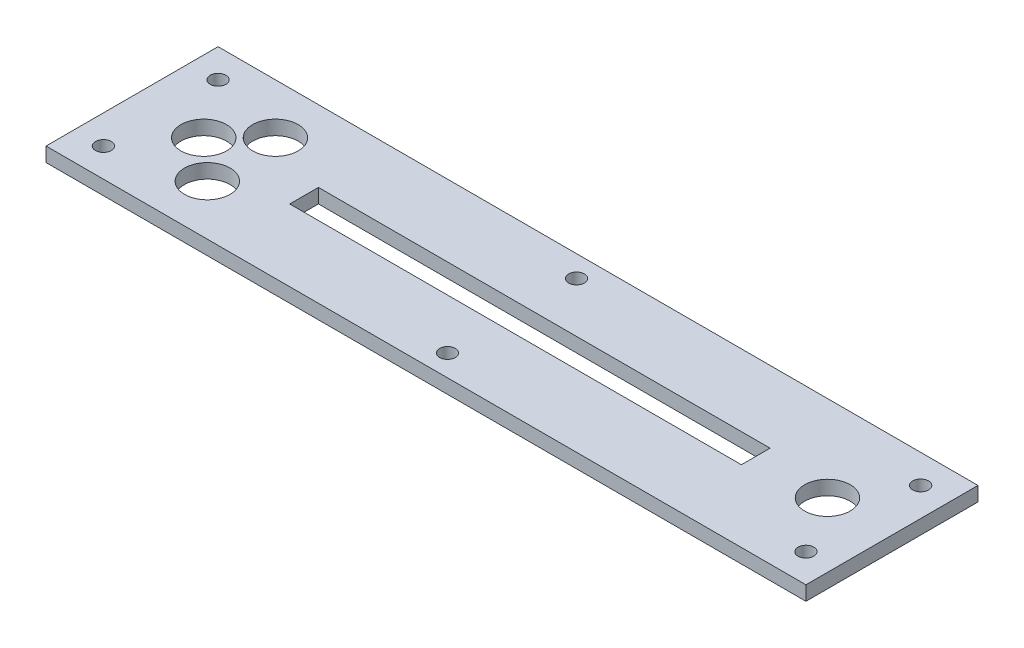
from build123d import *

# Parameters (mm, degrees)
SKETCH1_W           = 106
SKETCH1_H           = 24
SKETCH1_R           = 3.18
SKETCH1_R_2         = 1.1
SKETCH1_W_2         = 63
SKETCH1_H_2         = 4
BOSS_EXTRUDE1_DEPTH = 2


with BuildPart() as part:
    # Sketch1 → Boss-Extrude1 (new body)
    with BuildSketch(Plane(origin=(0, 0, 0), x_dir=(1, 0, 0), z_dir=(0, 1, 0))):
        with Locations((-0.5, 0)):
            Rectangle(SKETCH1_W, SKETCH1_H)
        with Locations(Location((-38.5, 5, 0), (0, 0, 270))):
            Circle(SKETCH1_R, mode=Mode.SUBTRACT)
        with Locations(Location((-43.5, 0, 0), (0, 0, 270))):
            Circle(SKETCH1_R, mode=Mode.SUBTRACT)
        with Locations(Location((-38, -5, 0), (0, 0, 270))):
            Circle(SKETCH1_R, mode=Mode.SUBTRACT)
        with Locations(Location((43.5, 0, 0), (0, 0, 270))):
            Circle(SKETCH1_R, mode=Mode.SUBTRACT)
        with Locations(Location((-49.5, 8, 0), (0, 0, 270))):
            Circle(SKETCH1_R_2, mode=Mode.SUBTRACT)
        with Locations(Location((-49.5, -8, 0), (0, 0, 270))):
            Circle(SKETCH1_R_2, mode=Mode.SUBTRACT)
        with Locations(Location((48.5, -8, 0), (0, 0, 270))):
            Circle(SKETCH1_R_2, mode=Mode.SUBTRACT)
        with Locations(Location((48.5, 8, 0), (0, 0, 270))):
            Circle(SKETCH1_R_2, mode=Mode.SUBTRACT)
        with Locations(Location((-0.5, -9, 0), (0, 0, 270))):
            Circle(SKETCH1_R_2, mode=Mode.SUBTRACT)
        with Locations(Location((-0.5, 9, 0), (0, 0, 270))):
            Circle(SKETCH1_R_2, mode=Mode.SUBTRACT)
        with Locations((2, 0)):
            Rectangle(SKETCH1_W_2, SKETCH1_H_2, mode=Mode.SUBTRACT)
    extrude(amount=BOSS_EXTRUDE1_DEPTH)


solid = part.part
